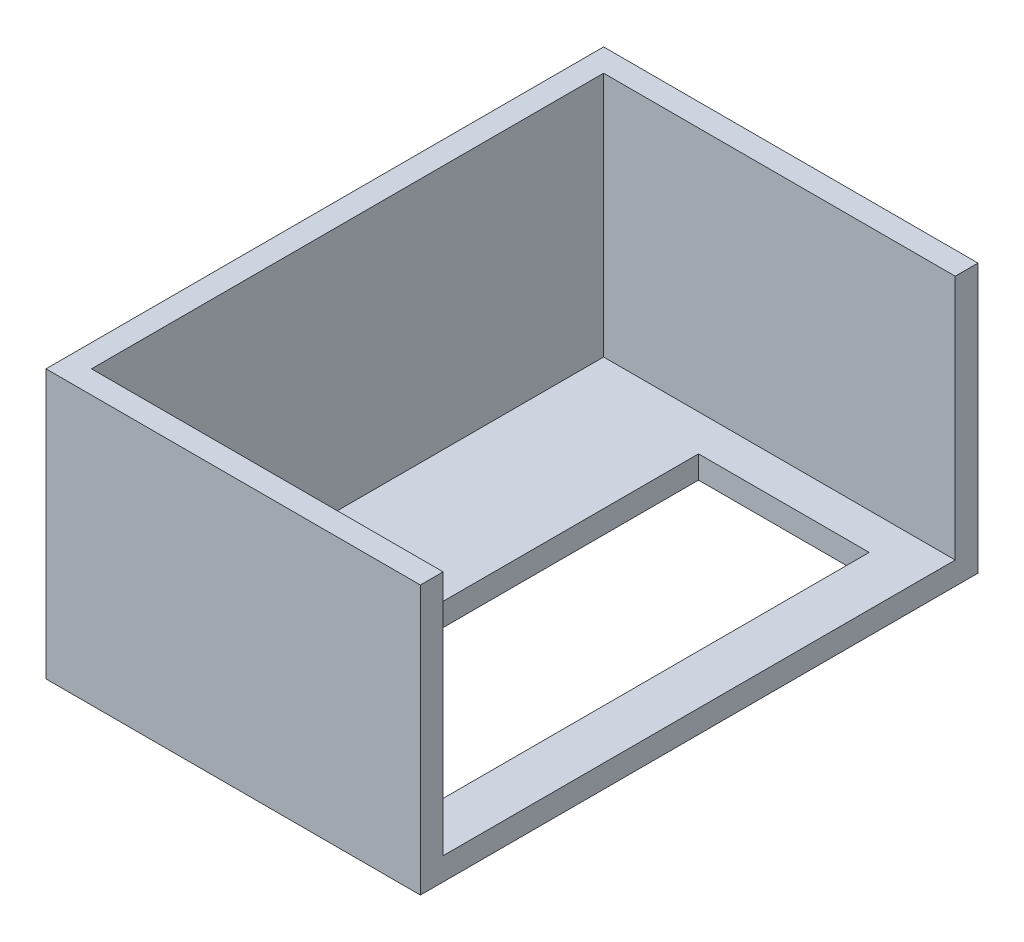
from build123d import *

# Parameters (mm, degrees)
SKETCH4_W           = 16.45
SKETCH4_H           = 24.5
BOSS_EXTRUDE1_DEPTH = 1
SKETCH5_W           = 16.45
SKETCH5_H           = 1
BOSS_EXTRUDE2_DEPTH = 10.8
SKETCH6_W           = 7.5
SKETCH6_H           = 19.3
CUT_EXTRUDE1_DEPTH  = 5796.953824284
SKETCH7_W           = 1
SKETCH7_H           = 22.5
BOSS_EXTRUDE3_DEPTH = 10.8


with BuildPart() as part:
    # Sketch4 → Boss-Extrude1 (new body)
    with BuildSketch(Plane(origin=(0, 0, 0), x_dir=(1, 0, 0), z_dir=(0, 1, 0))):
        with Locations((-4680.11019736, 3395.458492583)):
            Rectangle(SKETCH4_W, SKETCH4_H)
    extrude(amount=BOSS_EXTRUDE1_DEPTH)

    # Sketch5 → Boss-Extrude2 (add)
    with BuildSketch(Plane(origin=(0, 1, 0), x_dir=(1, 0, 0), z_dir=(0, 1, 0))):
        with Locations((-4680.11019736, 3407.208492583)):
            Rectangle(SKETCH5_W, SKETCH5_H)
        with Locations((-4680.11019736, 3383.708492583)):
            Rectangle(SKETCH5_W, SKETCH5_H)
    extrude(amount=BOSS_EXTRUDE2_DEPTH)

    # Sketch6 → Cut-Extrude1 (cut, through all)
    with BuildSketch(Plane(origin=(0, 1, 0), x_dir=(1, 0, 0), z_dir=(0, 1, 0))):
        with Locations((-4677.81519736, 3395.458492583)):
            Rectangle(SKETCH6_W, SKETCH6_H)
    extrude(amount=-CUT_EXTRUDE1_DEPTH, mode=Mode.SUBTRACT)

    # Sketch7 → Boss-Extrude3 (add)
    with BuildSketch(Plane(origin=(0, 1, 0), x_dir=(1, 0, 0), z_dir=(0, 1, 0))):
        with Locations((-4687.83519736, 3395.458492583)):
            Rectangle(SKETCH7_W, SKETCH7_H)
    extrude(amount=BOSS_EXTRUDE3_DEPTH)


solid = part.part
